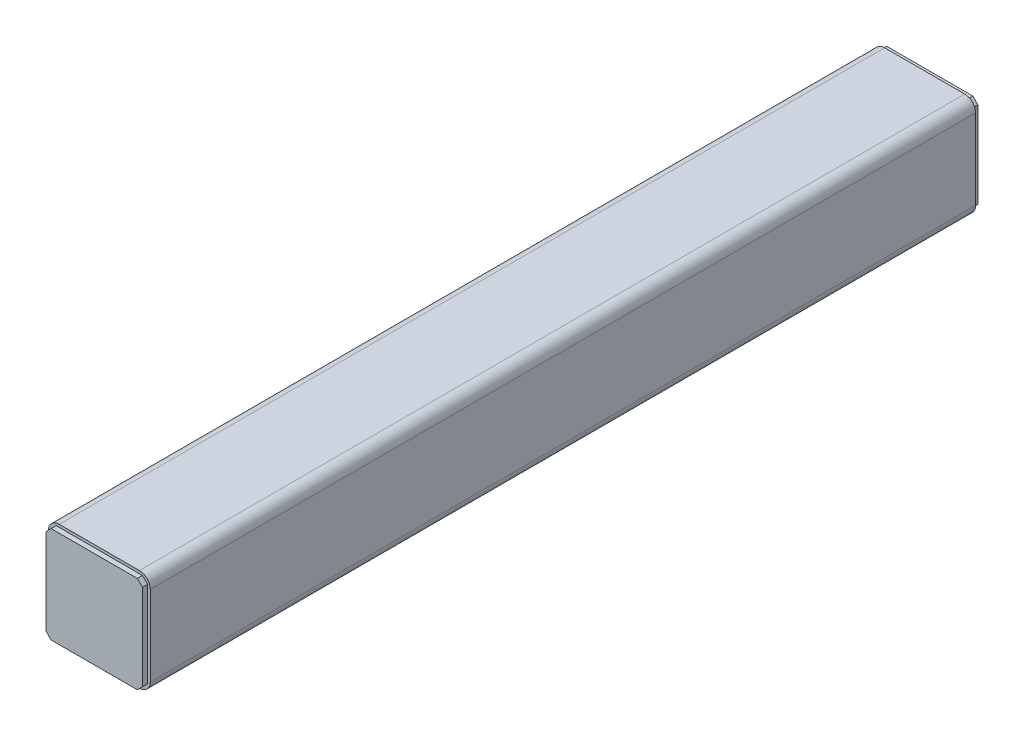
ISO-10303-21;
HEADER;
FILE_DESCRIPTION(('STEP AP214'),'2;1');
FILE_NAME('part.step','',(''),(''),'','','');
FILE_SCHEMA(('AUTOMOTIVE_DESIGN { 1 0 10303 214 1 1 1 1 }'));
ENDSEC;
DATA;
#1=APPLICATION_CONTEXT('core data for automotive mechanical design processes');
#2=APPLICATION_PROTOCOL_DEFINITION('international standard','automotive_design',2000,#1);
#3=PRODUCT_CONTEXT('',#1,'mechanical');
#4=PRODUCT('Part','Part','',(#3));
#5=PRODUCT_RELATED_PRODUCT_CATEGORY('part','',(#4));
#6=PRODUCT_DEFINITION_FORMATION('','',#4);
#7=PRODUCT_DEFINITION_CONTEXT('part definition',#1,'design');
#8=PRODUCT_DEFINITION('design','',#6,#7);
#9=PRODUCT_DEFINITION_SHAPE('','',#8);
#10=(LENGTH_UNIT() NAMED_UNIT(*) SI_UNIT(.MILLI.,.METRE.));
#11=(NAMED_UNIT(*) PLANE_ANGLE_UNIT() SI_UNIT($,.RADIAN.));
#12=(NAMED_UNIT(*) SI_UNIT($,.STERADIAN.) SOLID_ANGLE_UNIT());
#13=UNCERTAINTY_MEASURE_WITH_UNIT(LENGTH_MEASURE(1.E-05),#10,'distance_accuracy_value','');
#14=(GEOMETRIC_REPRESENTATION_CONTEXT(3) GLOBAL_UNCERTAINTY_ASSIGNED_CONTEXT((#13)) GLOBAL_UNIT_ASSIGNED_CONTEXT((#10,
#11,#12)) REPRESENTATION_CONTEXT('',''));
#15=CARTESIAN_POINT('',(0.,0.,0.));
#16=DIRECTION('',(0.,0.,1.));
#17=DIRECTION('',(1.,0.,0.));
#18=AXIS2_PLACEMENT_3D('',#15,#16,#17);
#19=CARTESIAN_POINT('',(28.4,25.4,-3.));
#20=DIRECTION('',(0.707106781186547,0.707106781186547,0.));
#21=DIRECTION('',(-0.707106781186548,0.707106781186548,0.));
#22=AXIS2_PLACEMENT_3D('',#19,#20,#21);
#23=PLANE('',#22);
#24=DIRECTION('',(-0.707106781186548,0.707106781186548,0.));
#25=VECTOR('',#24,1.);
#26=CARTESIAN_POINT('',(28.4,25.4,0.));
#27=LINE('',#26,#25);
#28=CARTESIAN_POINT('',(28.4,25.4,0.));
#29=VERTEX_POINT('',#28);
#30=CARTESIAN_POINT('',(25.4,28.4,0.));
#31=VERTEX_POINT('',#30);
#32=EDGE_CURVE('E194',#29,#31,#27,.T.);
#33=ORIENTED_EDGE('',*,*,#32,.F.);
#34=DIRECTION('',(0.,0.,1.));
#35=VECTOR('',#34,1.);
#36=CARTESIAN_POINT('',(28.4,25.4,-3.));
#37=LINE('',#36,#35);
#38=CARTESIAN_POINT('',(28.4,25.4,-3.));
#39=VERTEX_POINT('',#38);
#40=EDGE_CURVE('E13',#39,#29,#37,.T.);
#41=ORIENTED_EDGE('',*,*,#40,.F.);
#42=DIRECTION('',(-0.707106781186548,0.707106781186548,0.));
#43=VECTOR('',#42,1.);
#44=CARTESIAN_POINT('',(28.4,25.4,-3.));
#45=LINE('',#44,#43);
#46=CARTESIAN_POINT('',(25.4,28.4,-3.));
#47=VERTEX_POINT('',#46);
#48=EDGE_CURVE('E214',#39,#47,#45,.T.);
#49=ORIENTED_EDGE('',*,*,#48,.T.);
#50=DIRECTION('',(0.,0.,1.));
#51=VECTOR('',#50,1.);
#52=CARTESIAN_POINT('',(25.4,28.4,-3.));
#53=LINE('',#52,#51);
#54=EDGE_CURVE('E100',#47,#31,#53,.T.);
#55=ORIENTED_EDGE('',*,*,#54,.T.);
#56=EDGE_LOOP('',(#33,#41,#49,#55));
#57=FACE_BOUND('',#56,.T.);
#58=ADVANCED_FACE('F97',(#57),#23,.T.);
#59=CARTESIAN_POINT('',(28.4,-25.4,-3.));
#60=DIRECTION('',(1.,0.,0.));
#61=DIRECTION('',(0.,1.,0.));
#62=AXIS2_PLACEMENT_3D('',#59,#60,#61);
#63=PLANE('',#62);
#64=DIRECTION('',(0.,1.,0.));
#65=VECTOR('',#64,1.);
#66=CARTESIAN_POINT('',(28.4,-25.4,0.));
#67=LINE('',#66,#65);
#68=CARTESIAN_POINT('',(28.4,-25.4,0.));
#69=VERTEX_POINT('',#68);
#70=EDGE_CURVE('E212',#69,#29,#67,.T.);
#71=ORIENTED_EDGE('',*,*,#70,.F.);
#72=DIRECTION('',(0.,0.,1.));
#73=VECTOR('',#72,1.);
#74=CARTESIAN_POINT('',(28.4,-25.4,-3.));
#75=LINE('',#74,#73);
#76=CARTESIAN_POINT('',(28.4,-25.4,-3.));
#77=VERTEX_POINT('',#76);
#78=EDGE_CURVE('E106',#77,#69,#75,.T.);
#79=ORIENTED_EDGE('',*,*,#78,.F.);
#80=DIRECTION('',(0.,1.,0.));
#81=VECTOR('',#80,1.);
#82=CARTESIAN_POINT('',(28.4,-25.4,-3.));
#83=LINE('',#82,#81);
#84=EDGE_CURVE('E184',#77,#39,#83,.T.);
#85=ORIENTED_EDGE('',*,*,#84,.T.);
#86=ORIENTED_EDGE('',*,*,#40,.T.);
#87=EDGE_LOOP('',(#71,#79,#85,#86));
#88=FACE_BOUND('',#87,.T.);
#89=ADVANCED_FACE('F226',(#88),#63,.T.);
#90=CARTESIAN_POINT('',(25.4,-28.4,-3.));
#91=DIRECTION('',(0.707106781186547,-0.707106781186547,0.));
#92=DIRECTION('',(0.707106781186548,0.707106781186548,0.));
#93=AXIS2_PLACEMENT_3D('',#90,#91,#92);
#94=PLANE('',#93);
#95=DIRECTION('',(0.707106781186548,0.707106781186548,0.));
#96=VECTOR('',#95,1.);
#97=CARTESIAN_POINT('',(25.4,-28.4,0.));
#98=LINE('',#97,#96);
#99=CARTESIAN_POINT('',(25.4,-28.4,0.));
#100=VERTEX_POINT('',#99);
#101=EDGE_CURVE('E171',#100,#69,#98,.T.);
#102=ORIENTED_EDGE('',*,*,#101,.F.);
#103=DIRECTION('',(0.,0.,1.));
#104=VECTOR('',#103,1.);
#105=CARTESIAN_POINT('',(25.4,-28.4,-3.));
#106=LINE('',#105,#104);
#107=CARTESIAN_POINT('',(25.4,-28.4,-3.));
#108=VERTEX_POINT('',#107);
#109=EDGE_CURVE('E166',#108,#100,#106,.T.);
#110=ORIENTED_EDGE('',*,*,#109,.F.);
#111=DIRECTION('',(0.707106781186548,0.707106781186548,0.));
#112=VECTOR('',#111,1.);
#113=CARTESIAN_POINT('',(25.4,-28.4,-3.));
#114=LINE('',#113,#112);
#115=EDGE_CURVE('E169',#108,#77,#114,.T.);
#116=ORIENTED_EDGE('',*,*,#115,.T.);
#117=ORIENTED_EDGE('',*,*,#78,.T.);
#118=EDGE_LOOP('',(#102,#110,#116,#117));
#119=FACE_BOUND('',#118,.T.);
#120=ADVANCED_FACE('F168',(#119),#94,.T.);
#121=CARTESIAN_POINT('',(-25.4,-28.4,-3.));
#122=DIRECTION('',(0.,-1.,0.));
#123=DIRECTION('',(1.,0.,0.));
#124=AXIS2_PLACEMENT_3D('',#121,#122,#123);
#125=PLANE('',#124);
#126=DIRECTION('',(1.,0.,0.));
#127=VECTOR('',#126,1.);
#128=CARTESIAN_POINT('',(-25.4,-28.4,0.));
#129=LINE('',#128,#127);
#130=CARTESIAN_POINT('',(-25.4,-28.4,0.));
#131=VERTEX_POINT('',#130);
#132=EDGE_CURVE('E209',#131,#100,#129,.T.);
#133=ORIENTED_EDGE('',*,*,#132,.F.);
#134=DIRECTION('',(0.,0.,1.));
#135=VECTOR('',#134,1.);
#136=CARTESIAN_POINT('',(-25.4,-28.4,-3.));
#137=LINE('',#136,#135);
#138=CARTESIAN_POINT('',(-25.4,-28.4,-3.));
#139=VERTEX_POINT('',#138);
#140=EDGE_CURVE('E176',#139,#131,#137,.T.);
#141=ORIENTED_EDGE('',*,*,#140,.F.);
#142=DIRECTION('',(1.,0.,0.));
#143=VECTOR('',#142,1.);
#144=CARTESIAN_POINT('',(-25.4,-28.4,-3.));
#145=LINE('',#144,#143);
#146=EDGE_CURVE('E182',#139,#108,#145,.T.);
#147=ORIENTED_EDGE('',*,*,#146,.T.);
#148=ORIENTED_EDGE('',*,*,#109,.T.);
#149=EDGE_LOOP('',(#133,#141,#147,#148));
#150=FACE_BOUND('',#149,.T.);
#151=ADVANCED_FACE('F186',(#150),#125,.T.);
#152=CARTESIAN_POINT('',(-28.4,-25.4,-3.));
#153=DIRECTION('',(-0.707106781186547,-0.707106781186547,0.));
#154=DIRECTION('',(0.707106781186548,-0.707106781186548,0.));
#155=AXIS2_PLACEMENT_3D('',#152,#153,#154);
#156=PLANE('',#155);
#157=DIRECTION('',(0.707106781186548,-0.707106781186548,0.));
#158=VECTOR('',#157,1.);
#159=CARTESIAN_POINT('',(-28.4,-25.4,0.));
#160=LINE('',#159,#158);
#161=CARTESIAN_POINT('',(-28.4,-25.4,0.));
#162=VERTEX_POINT('',#161);
#163=EDGE_CURVE('E206',#162,#131,#160,.T.);
#164=ORIENTED_EDGE('',*,*,#163,.F.);
#165=DIRECTION('',(0.,0.,1.));
#166=VECTOR('',#165,1.);
#167=CARTESIAN_POINT('',(-28.4,-25.4,-3.));
#168=LINE('',#167,#166);
#169=CARTESIAN_POINT('',(-28.4,-25.4,-3.));
#170=VERTEX_POINT('',#169);
#171=EDGE_CURVE('E218',#170,#162,#168,.T.);
#172=ORIENTED_EDGE('',*,*,#171,.F.);
#173=DIRECTION('',(0.707106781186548,-0.707106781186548,0.));
#174=VECTOR('',#173,1.);
#175=CARTESIAN_POINT('',(-28.4,-25.4,-3.));
#176=LINE('',#175,#174);
#177=EDGE_CURVE('E187',#170,#139,#176,.T.);
#178=ORIENTED_EDGE('',*,*,#177,.T.);
#179=ORIENTED_EDGE('',*,*,#140,.T.);
#180=EDGE_LOOP('',(#164,#172,#178,#179));
#181=FACE_BOUND('',#180,.T.);
#182=ADVANCED_FACE('F239',(#181),#156,.T.);
#183=CARTESIAN_POINT('',(-28.4,25.4,-3.));
#184=DIRECTION('',(-1.,0.,0.));
#185=DIRECTION('',(0.,-1.,0.));
#186=AXIS2_PLACEMENT_3D('',#183,#184,#185);
#187=PLANE('',#186);
#188=DIRECTION('',(0.,-1.,0.));
#189=VECTOR('',#188,1.);
#190=CARTESIAN_POINT('',(-28.4,25.4,0.));
#191=LINE('',#190,#189);
#192=CARTESIAN_POINT('',(-28.4,25.4,0.));
#193=VERTEX_POINT('',#192);
#194=EDGE_CURVE('E203',#193,#162,#191,.T.);
#195=ORIENTED_EDGE('',*,*,#194,.F.);
#196=DIRECTION('',(0.,0.,1.));
#197=VECTOR('',#196,1.);
#198=CARTESIAN_POINT('',(-28.4,25.4,-3.));
#199=LINE('',#198,#197);
#200=CARTESIAN_POINT('',(-28.4,25.4,-3.));
#201=VERTEX_POINT('',#200);
#202=EDGE_CURVE('E220',#201,#193,#199,.T.);
#203=ORIENTED_EDGE('',*,*,#202,.F.);
#204=DIRECTION('',(0.,-1.,0.));
#205=VECTOR('',#204,1.);
#206=CARTESIAN_POINT('',(-28.4,25.4,-3.));
#207=LINE('',#206,#205);
#208=EDGE_CURVE('E189',#201,#170,#207,.T.);
#209=ORIENTED_EDGE('',*,*,#208,.T.);
#210=ORIENTED_EDGE('',*,*,#171,.T.);
#211=EDGE_LOOP('',(#195,#203,#209,#210));
#212=FACE_BOUND('',#211,.T.);
#213=ADVANCED_FACE('F242',(#212),#187,.T.);
#214=CARTESIAN_POINT('',(-25.4,28.4,-3.));
#215=DIRECTION('',(-0.707106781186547,0.707106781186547,0.));
#216=DIRECTION('',(-0.707106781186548,-0.707106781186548,0.));
#217=AXIS2_PLACEMENT_3D('',#214,#215,#216);
#218=PLANE('',#217);
#219=DIRECTION('',(-0.707106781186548,-0.707106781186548,0.));
#220=VECTOR('',#219,1.);
#221=CARTESIAN_POINT('',(-25.4,28.4,0.));
#222=LINE('',#221,#220);
#223=CARTESIAN_POINT('',(-25.4,28.4,0.));
#224=VERTEX_POINT('',#223);
#225=EDGE_CURVE('E200',#224,#193,#222,.T.);
#226=ORIENTED_EDGE('',*,*,#225,.F.);
#227=DIRECTION('',(0.,0.,1.));
#228=VECTOR('',#227,1.);
#229=CARTESIAN_POINT('',(-25.4,28.4,-3.));
#230=LINE('',#229,#228);
#231=CARTESIAN_POINT('',(-25.4,28.4,-3.));
#232=VERTEX_POINT('',#231);
#233=EDGE_CURVE('E221',#232,#224,#230,.T.);
#234=ORIENTED_EDGE('',*,*,#233,.F.);
#235=DIRECTION('',(-0.707106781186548,-0.707106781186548,0.));
#236=VECTOR('',#235,1.);
#237=CARTESIAN_POINT('',(-25.4,28.4,-3.));
#238=LINE('',#237,#236);
#239=EDGE_CURVE('E317',#232,#201,#238,.T.);
#240=ORIENTED_EDGE('',*,*,#239,.T.);
#241=ORIENTED_EDGE('',*,*,#202,.T.);
#242=EDGE_LOOP('',(#226,#234,#240,#241));
#243=FACE_BOUND('',#242,.T.);
#244=ADVANCED_FACE('F246',(#243),#218,.T.);
#245=CARTESIAN_POINT('',(25.4,28.4,-3.));
#246=DIRECTION('',(0.,1.,0.));
#247=DIRECTION('',(-1.,0.,0.));
#248=AXIS2_PLACEMENT_3D('',#245,#246,#247);
#249=PLANE('',#248);
#250=DIRECTION('',(-1.,0.,0.));
#251=VECTOR('',#250,1.);
#252=CARTESIAN_POINT('',(25.4,28.4,0.));
#253=LINE('',#252,#251);
#254=EDGE_CURVE('E197',#31,#224,#253,.T.);
#255=ORIENTED_EDGE('',*,*,#254,.F.);
#256=ORIENTED_EDGE('',*,*,#54,.F.);
#257=DIRECTION('',(-1.,0.,0.));
#258=VECTOR('',#257,1.);
#259=CARTESIAN_POINT('',(25.4,28.4,-3.));
#260=LINE('',#259,#258);
#261=EDGE_CURVE('E318',#47,#232,#260,.T.);
#262=ORIENTED_EDGE('',*,*,#261,.T.);
#263=ORIENTED_EDGE('',*,*,#233,.T.);
#264=EDGE_LOOP('',(#255,#256,#262,#263));
#265=FACE_BOUND('',#264,.T.);
#266=ADVANCED_FACE('F223',(#265),#249,.T.);
#267=CARTESIAN_POINT('',(0.,53.8,-3.));
#268=DIRECTION('',(0.,0.,1.));
#269=DIRECTION('',(1.,0.,0.));
#270=AXIS2_PLACEMENT_3D('',#267,#268,#269);
#271=PLANE('',#270);
#272=ORIENTED_EDGE('',*,*,#48,.F.);
#273=ORIENTED_EDGE('',*,*,#84,.F.);
#274=ORIENTED_EDGE('',*,*,#115,.F.);
#275=ORIENTED_EDGE('',*,*,#146,.F.);
#276=ORIENTED_EDGE('',*,*,#177,.F.);
#277=ORIENTED_EDGE('',*,*,#208,.F.);
#278=ORIENTED_EDGE('',*,*,#239,.F.);
#279=ORIENTED_EDGE('',*,*,#261,.F.);
#280=EDGE_LOOP('',(#272,#273,#274,#275,#276,#277,#278,#279));
#281=FACE_BOUND('',#280,.T.);
#282=ADVANCED_FACE('F180',(#281),#271,.F.);
#283=CARTESIAN_POINT('',(0.,53.8,0.));
#284=DIRECTION('',(0.,0.,1.));
#285=DIRECTION('',(1.,0.,0.));
#286=AXIS2_PLACEMENT_3D('',#283,#284,#285);
#287=PLANE('',#286);
#288=ORIENTED_EDGE('',*,*,#32,.T.);
#289=ORIENTED_EDGE('',*,*,#254,.T.);
#290=ORIENTED_EDGE('',*,*,#225,.T.);
#291=ORIENTED_EDGE('',*,*,#194,.T.);
#292=ORIENTED_EDGE('',*,*,#163,.T.);
#293=ORIENTED_EDGE('',*,*,#132,.T.);
#294=ORIENTED_EDGE('',*,*,#101,.T.);
#295=ORIENTED_EDGE('',*,*,#70,.T.);
#296=EDGE_LOOP('',(#288,#289,#290,#291,#292,#293,#294,#295));
#297=FACE_BOUND('',#296,.T.);
#298=ADVANCED_FACE('F225',(#297),#287,.T.);
#299=CLOSED_SHELL('',(#58,#89,#120,#151,#182,#213,#244,#266,#282,#298));
#300=MANIFOLD_SOLID_BREP('B2',#299);
#301=CARTESIAN_POINT('',(25.4,28.4,-489.));
#302=DIRECTION('',(0.707106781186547,0.707106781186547,0.));
#303=DIRECTION('',(-0.707106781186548,0.707106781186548,0.));
#304=AXIS2_PLACEMENT_3D('',#301,#302,#303);
#305=PLANE('',#304);
#306=DIRECTION('',(0.707106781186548,-0.707106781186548,0.));
#307=VECTOR('',#306,1.);
#308=CARTESIAN_POINT('',(25.4,28.4,-492.));
#309=LINE('',#308,#307);
#310=CARTESIAN_POINT('',(25.4,28.4,-492.));
#311=VERTEX_POINT('',#310);
#312=CARTESIAN_POINT('',(28.4,25.4,-492.));
#313=VERTEX_POINT('',#312);
#314=EDGE_CURVE('E430',#311,#313,#309,.T.);
#315=ORIENTED_EDGE('',*,*,#314,.F.);
#316=DIRECTION('',(0.,0.,-1.));
#317=VECTOR('',#316,1.);
#318=CARTESIAN_POINT('',(25.4,28.4,-489.));
#319=LINE('',#318,#317);
#320=CARTESIAN_POINT('',(25.4,28.4,-489.));
#321=VERTEX_POINT('',#320);
#322=EDGE_CURVE('E95',#321,#311,#319,.T.);
#323=ORIENTED_EDGE('',*,*,#322,.F.);
#324=DIRECTION('',(0.707106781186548,-0.707106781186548,0.));
#325=VECTOR('',#324,1.);
#326=CARTESIAN_POINT('',(25.4,28.4,-489.));
#327=LINE('',#326,#325);
#328=CARTESIAN_POINT('',(28.4,25.4,-489.));
#329=VERTEX_POINT('',#328);
#330=EDGE_CURVE('E450',#321,#329,#327,.T.);
#331=ORIENTED_EDGE('',*,*,#330,.T.);
#332=DIRECTION('',(0.,0.,-1.));
#333=VECTOR('',#332,1.);
#334=CARTESIAN_POINT('',(28.4,25.4,-489.));
#335=LINE('',#334,#333);
#336=EDGE_CURVE('E336',#329,#313,#335,.T.);
#337=ORIENTED_EDGE('',*,*,#336,.T.);
#338=EDGE_LOOP('',(#315,#323,#331,#337));
#339=FACE_BOUND('',#338,.T.);
#340=ADVANCED_FACE('F333',(#339),#305,.T.);
#341=CARTESIAN_POINT('',(-25.4,28.4,-489.));
#342=DIRECTION('',(0.,1.,0.));
#343=DIRECTION('',(-1.,0.,0.));
#344=AXIS2_PLACEMENT_3D('',#341,#342,#343);
#345=PLANE('',#344);
#346=DIRECTION('',(1.,0.,0.));
#347=VECTOR('',#346,1.);
#348=CARTESIAN_POINT('',(-25.4,28.4,-492.));
#349=LINE('',#348,#347);
#350=CARTESIAN_POINT('',(-25.4,28.4,-492.));
#351=VERTEX_POINT('',#350);
#352=EDGE_CURVE('E448',#351,#311,#349,.T.);
#353=ORIENTED_EDGE('',*,*,#352,.F.);
#354=DIRECTION('',(0.,0.,-1.));
#355=VECTOR('',#354,1.);
#356=CARTESIAN_POINT('',(-25.4,28.4,-489.));
#357=LINE('',#356,#355);
#358=CARTESIAN_POINT('',(-25.4,28.4,-489.));
#359=VERTEX_POINT('',#358);
#360=EDGE_CURVE('E342',#359,#351,#357,.T.);
#361=ORIENTED_EDGE('',*,*,#360,.F.);
#362=DIRECTION('',(1.,0.,0.));
#363=VECTOR('',#362,1.);
#364=CARTESIAN_POINT('',(-25.4,28.4,-489.));
#365=LINE('',#364,#363);
#366=EDGE_CURVE('E420',#359,#321,#365,.T.);
#367=ORIENTED_EDGE('',*,*,#366,.T.);
#368=ORIENTED_EDGE('',*,*,#322,.T.);
#369=EDGE_LOOP('',(#353,#361,#367,#368));
#370=FACE_BOUND('',#369,.T.);
#371=ADVANCED_FACE('F462',(#370),#345,.T.);
#372=CARTESIAN_POINT('',(-28.4,25.4,-489.));
#373=DIRECTION('',(-0.707106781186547,0.707106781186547,0.));
#374=DIRECTION('',(-0.707106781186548,-0.707106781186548,0.));
#375=AXIS2_PLACEMENT_3D('',#372,#373,#374);
#376=PLANE('',#375);
#377=DIRECTION('',(0.707106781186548,0.707106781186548,0.));
#378=VECTOR('',#377,1.);
#379=CARTESIAN_POINT('',(-28.4,25.4,-492.));
#380=LINE('',#379,#378);
#381=CARTESIAN_POINT('',(-28.4,25.4,-492.));
#382=VERTEX_POINT('',#381);
#383=EDGE_CURVE('E407',#382,#351,#380,.T.);
#384=ORIENTED_EDGE('',*,*,#383,.F.);
#385=DIRECTION('',(0.,0.,-1.));
#386=VECTOR('',#385,1.);
#387=CARTESIAN_POINT('',(-28.4,25.4,-489.));
#388=LINE('',#387,#386);
#389=CARTESIAN_POINT('',(-28.4,25.4,-489.));
#390=VERTEX_POINT('',#389);
#391=EDGE_CURVE('E402',#390,#382,#388,.T.);
#392=ORIENTED_EDGE('',*,*,#391,.F.);
#393=DIRECTION('',(0.707106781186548,0.707106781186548,0.));
#394=VECTOR('',#393,1.);
#395=CARTESIAN_POINT('',(-28.4,25.4,-489.));
#396=LINE('',#395,#394);
#397=EDGE_CURVE('E405',#390,#359,#396,.T.);
#398=ORIENTED_EDGE('',*,*,#397,.T.);
#399=ORIENTED_EDGE('',*,*,#360,.T.);
#400=EDGE_LOOP('',(#384,#392,#398,#399));
#401=FACE_BOUND('',#400,.T.);
#402=ADVANCED_FACE('F404',(#401),#376,.T.);
#403=CARTESIAN_POINT('',(-28.4,-25.4,-489.));
#404=DIRECTION('',(-1.,0.,0.));
#405=DIRECTION('',(0.,0.,1.));
#406=AXIS2_PLACEMENT_3D('',#403,#404,#405);
#407=PLANE('',#406);
#408=DIRECTION('',(0.,1.,0.));
#409=VECTOR('',#408,1.);
#410=CARTESIAN_POINT('',(-28.4,-25.4,-492.));
#411=LINE('',#410,#409);
#412=CARTESIAN_POINT('',(-28.4,-25.4,-492.));
#413=VERTEX_POINT('',#412);
#414=EDGE_CURVE('E445',#413,#382,#411,.T.);
#415=ORIENTED_EDGE('',*,*,#414,.F.);
#416=DIRECTION('',(0.,0.,-1.));
#417=VECTOR('',#416,1.);
#418=CARTESIAN_POINT('',(-28.4,-25.4,-489.));
#419=LINE('',#418,#417);
#420=CARTESIAN_POINT('',(-28.4,-25.4,-489.));
#421=VERTEX_POINT('',#420);
#422=EDGE_CURVE('E412',#421,#413,#419,.T.);
#423=ORIENTED_EDGE('',*,*,#422,.F.);
#424=DIRECTION('',(0.,1.,0.));
#425=VECTOR('',#424,1.);
#426=CARTESIAN_POINT('',(-28.4,-25.4,-489.));
#427=LINE('',#426,#425);
#428=EDGE_CURVE('E418',#421,#390,#427,.T.);
#429=ORIENTED_EDGE('',*,*,#428,.T.);
#430=ORIENTED_EDGE('',*,*,#391,.T.);
#431=EDGE_LOOP('',(#415,#423,#429,#430));
#432=FACE_BOUND('',#431,.T.);
#433=ADVANCED_FACE('F422',(#432),#407,.T.);
#434=CARTESIAN_POINT('',(-25.4,-28.4,-489.));
#435=DIRECTION('',(-0.707106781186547,-0.707106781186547,0.));
#436=DIRECTION('',(0.707106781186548,-0.707106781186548,0.));
#437=AXIS2_PLACEMENT_3D('',#434,#435,#436);
#438=PLANE('',#437);
#439=DIRECTION('',(-0.707106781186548,0.707106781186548,0.));
#440=VECTOR('',#439,1.);
#441=CARTESIAN_POINT('',(-25.4,-28.4,-492.));
#442=LINE('',#441,#440);
#443=CARTESIAN_POINT('',(-25.4,-28.4,-492.));
#444=VERTEX_POINT('',#443);
#445=EDGE_CURVE('E442',#444,#413,#442,.T.);
#446=ORIENTED_EDGE('',*,*,#445,.F.);
#447=DIRECTION('',(0.,0.,-1.));
#448=VECTOR('',#447,1.);
#449=CARTESIAN_POINT('',(-25.4,-28.4,-489.));
#450=LINE('',#449,#448);
#451=CARTESIAN_POINT('',(-25.4,-28.4,-489.));
#452=VERTEX_POINT('',#451);
#453=EDGE_CURVE('E454',#452,#444,#450,.T.);
#454=ORIENTED_EDGE('',*,*,#453,.F.);
#455=DIRECTION('',(-0.707106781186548,0.707106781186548,0.));
#456=VECTOR('',#455,1.);
#457=CARTESIAN_POINT('',(-25.4,-28.4,-489.));
#458=LINE('',#457,#456);
#459=EDGE_CURVE('E423',#452,#421,#458,.T.);
#460=ORIENTED_EDGE('',*,*,#459,.T.);
#461=ORIENTED_EDGE('',*,*,#422,.T.);
#462=EDGE_LOOP('',(#446,#454,#460,#461));
#463=FACE_BOUND('',#462,.T.);
#464=ADVANCED_FACE('F475',(#463),#438,.T.);
#465=CARTESIAN_POINT('',(25.4,-28.4,-489.));
#466=DIRECTION('',(0.,-1.,0.));
#467=DIRECTION('',(1.,0.,0.));
#468=AXIS2_PLACEMENT_3D('',#465,#466,#467);
#469=PLANE('',#468);
#470=DIRECTION('',(-1.,0.,0.));
#471=VECTOR('',#470,1.);
#472=CARTESIAN_POINT('',(25.4,-28.4,-492.));
#473=LINE('',#472,#471);
#474=CARTESIAN_POINT('',(25.4,-28.4,-492.));
#475=VERTEX_POINT('',#474);
#476=EDGE_CURVE('E439',#475,#444,#473,.T.);
#477=ORIENTED_EDGE('',*,*,#476,.F.);
#478=DIRECTION('',(0.,0.,-1.));
#479=VECTOR('',#478,1.);
#480=CARTESIAN_POINT('',(25.4,-28.4,-489.));
#481=LINE('',#480,#479);
#482=CARTESIAN_POINT('',(25.4,-28.4,-489.));
#483=VERTEX_POINT('',#482);
#484=EDGE_CURVE('E456',#483,#475,#481,.T.);
#485=ORIENTED_EDGE('',*,*,#484,.F.);
#486=DIRECTION('',(-1.,0.,0.));
#487=VECTOR('',#486,1.);
#488=CARTESIAN_POINT('',(25.4,-28.4,-489.));
#489=LINE('',#488,#487);
#490=EDGE_CURVE('E425',#483,#452,#489,.T.);
#491=ORIENTED_EDGE('',*,*,#490,.T.);
#492=ORIENTED_EDGE('',*,*,#453,.T.);
#493=EDGE_LOOP('',(#477,#485,#491,#492));
#494=FACE_BOUND('',#493,.T.);
#495=ADVANCED_FACE('F478',(#494),#469,.T.);
#496=CARTESIAN_POINT('',(28.4,-25.4,-489.));
#497=DIRECTION('',(0.707106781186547,-0.707106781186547,0.));
#498=DIRECTION('',(0.707106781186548,0.707106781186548,0.));
#499=AXIS2_PLACEMENT_3D('',#496,#497,#498);
#500=PLANE('',#499);
#501=DIRECTION('',(-0.707106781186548,-0.707106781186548,0.));
#502=VECTOR('',#501,1.);
#503=CARTESIAN_POINT('',(28.4,-25.4,-492.));
#504=LINE('',#503,#502);
#505=CARTESIAN_POINT('',(28.4,-25.4,-492.));
#506=VERTEX_POINT('',#505);
#507=EDGE_CURVE('E436',#506,#475,#504,.T.);
#508=ORIENTED_EDGE('',*,*,#507,.F.);
#509=DIRECTION('',(0.,0.,-1.));
#510=VECTOR('',#509,1.);
#511=CARTESIAN_POINT('',(28.4,-25.4,-489.));
#512=LINE('',#511,#510);
#513=CARTESIAN_POINT('',(28.4,-25.4,-489.));
#514=VERTEX_POINT('',#513);
#515=EDGE_CURVE('E457',#514,#506,#512,.T.);
#516=ORIENTED_EDGE('',*,*,#515,.F.);
#517=DIRECTION('',(-0.707106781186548,-0.707106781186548,0.));
#518=VECTOR('',#517,1.);
#519=CARTESIAN_POINT('',(28.4,-25.4,-489.));
#520=LINE('',#519,#518);
#521=EDGE_CURVE('E555',#514,#483,#520,.T.);
#522=ORIENTED_EDGE('',*,*,#521,.T.);
#523=ORIENTED_EDGE('',*,*,#484,.T.);
#524=EDGE_LOOP('',(#508,#516,#522,#523));
#525=FACE_BOUND('',#524,.T.);
#526=ADVANCED_FACE('F482',(#525),#500,.T.);
#527=CARTESIAN_POINT('',(28.4,25.4,-489.));
#528=DIRECTION('',(1.,0.,0.));
#529=DIRECTION('',(0.,1.,0.));
#530=AXIS2_PLACEMENT_3D('',#527,#528,#529);
#531=PLANE('',#530);
#532=DIRECTION('',(0.,-1.,0.));
#533=VECTOR('',#532,1.);
#534=CARTESIAN_POINT('',(28.4,25.4,-492.));
#535=LINE('',#534,#533);
#536=EDGE_CURVE('E433',#313,#506,#535,.T.);
#537=ORIENTED_EDGE('',*,*,#536,.F.);
#538=ORIENTED_EDGE('',*,*,#336,.F.);
#539=DIRECTION('',(0.,-1.,0.));
#540=VECTOR('',#539,1.);
#541=CARTESIAN_POINT('',(28.4,25.4,-489.));
#542=LINE('',#541,#540);
#543=EDGE_CURVE('E556',#329,#514,#542,.T.);
#544=ORIENTED_EDGE('',*,*,#543,.T.);
#545=ORIENTED_EDGE('',*,*,#515,.T.);
#546=EDGE_LOOP('',(#537,#538,#544,#545));
#547=FACE_BOUND('',#546,.T.);
#548=ADVANCED_FACE('F459',(#547),#531,.T.);
#549=CARTESIAN_POINT('',(53.8,0.,-489.));
#550=DIRECTION('',(0.,0.,-1.));
#551=DIRECTION('',(-1.,0.,0.));
#552=AXIS2_PLACEMENT_3D('',#549,#550,#551);
#553=PLANE('',#552);
#554=ORIENTED_EDGE('',*,*,#330,.F.);
#555=ORIENTED_EDGE('',*,*,#366,.F.);
#556=ORIENTED_EDGE('',*,*,#397,.F.);
#557=ORIENTED_EDGE('',*,*,#428,.F.);
#558=ORIENTED_EDGE('',*,*,#459,.F.);
#559=ORIENTED_EDGE('',*,*,#490,.F.);
#560=ORIENTED_EDGE('',*,*,#521,.F.);
#561=ORIENTED_EDGE('',*,*,#543,.F.);
#562=EDGE_LOOP('',(#554,#555,#556,#557,#558,#559,#560,#561));
#563=FACE_BOUND('',#562,.T.);
#564=ADVANCED_FACE('F416',(#563),#553,.F.);
#565=CARTESIAN_POINT('',(53.8,0.,-492.));
#566=DIRECTION('',(0.,0.,-1.));
#567=DIRECTION('',(-1.,0.,0.));
#568=AXIS2_PLACEMENT_3D('',#565,#566,#567);
#569=PLANE('',#568);
#570=ORIENTED_EDGE('',*,*,#314,.T.);
#571=ORIENTED_EDGE('',*,*,#536,.T.);
#572=ORIENTED_EDGE('',*,*,#507,.T.);
#573=ORIENTED_EDGE('',*,*,#476,.T.);
#574=ORIENTED_EDGE('',*,*,#445,.T.);
#575=ORIENTED_EDGE('',*,*,#414,.T.);
#576=ORIENTED_EDGE('',*,*,#383,.T.);
#577=ORIENTED_EDGE('',*,*,#352,.T.);
#578=EDGE_LOOP('',(#570,#571,#572,#573,#574,#575,#576,#577));
#579=FACE_BOUND('',#578,.T.);
#580=ADVANCED_FACE('F461',(#579),#569,.T.);
#581=CLOSED_SHELL('',(#340,#371,#402,#433,#464,#495,#526,#548,#564,#580));
#582=MANIFOLD_SOLID_BREP('B7',#581);
#583=CARTESIAN_POINT('',(23.6,23.6,-492.));
#584=DIRECTION('',(0.,0.,1.));
#585=DIRECTION('',(1.,0.,0.));
#586=AXIS2_PLACEMENT_3D('',#583,#584,#585);
#587=CYLINDRICAL_SURFACE('',#586,6.4);
#588=CARTESIAN_POINT('',(23.6,23.6,-3.));
#589=DIRECTION('',(0.,0.,1.));
#590=DIRECTION('',(1.,0.,0.));
#591=AXIS2_PLACEMENT_3D('',#588,#589,#590);
#592=CIRCLE('',#591,6.4);
#593=CARTESIAN_POINT('',(23.6,30.,-3.));
#594=VERTEX_POINT('',#593);
#595=CARTESIAN_POINT('',(30.,23.6,-3.));
#596=VERTEX_POINT('',#595);
#597=EDGE_CURVE('E765',#594,#596,#592,.F.);
#598=ORIENTED_EDGE('',*,*,#597,.T.);
#599=DIRECTION('',(0.,0.,1.));
#600=VECTOR('',#599,1.);
#601=CARTESIAN_POINT('',(30.,23.6,-492.));
#602=LINE('',#601,#600);
#603=CARTESIAN_POINT('',(30.,23.6,-489.));
#604=VERTEX_POINT('',#603);
#605=EDGE_CURVE('E331',#604,#596,#602,.T.);
#606=ORIENTED_EDGE('',*,*,#605,.F.);
#607=CARTESIAN_POINT('',(23.6,23.6,-489.));
#608=DIRECTION('',(0.,0.,-1.));
#609=DIRECTION('',(-1.,0.,0.));
#610=AXIS2_PLACEMENT_3D('',#607,#608,#609);
#611=CIRCLE('',#610,6.4);
#612=CARTESIAN_POINT('',(23.6,30.,-489.));
#613=VERTEX_POINT('',#612);
#614=EDGE_CURVE('E712',#613,#604,#611,.T.);
#615=ORIENTED_EDGE('',*,*,#614,.F.);
#616=DIRECTION('',(0.,0.,1.));
#617=VECTOR('',#616,1.);
#618=CARTESIAN_POINT('',(23.6,30.,-492.));
#619=LINE('',#618,#617);
#620=EDGE_CURVE('E797',#613,#594,#619,.T.);
#621=ORIENTED_EDGE('',*,*,#620,.T.);
#622=EDGE_LOOP('',(#598,#606,#615,#621));
#623=FACE_BOUND('',#622,.T.);
#624=ADVANCED_FACE('F562',(#623),#587,.T.);
#625=CARTESIAN_POINT('',(30.,23.6,-492.));
#626=DIRECTION('',(-1.,0.,0.));
#627=DIRECTION('',(0.,-1.,0.));
#628=AXIS2_PLACEMENT_3D('',#625,#626,#627);
#629=PLANE('',#628);
#630=DIRECTION('',(0.,1.,0.));
#631=VECTOR('',#630,1.);
#632=CARTESIAN_POINT('',(30.,23.6,-3.));
#633=LINE('',#632,#631);
#634=CARTESIAN_POINT('',(30.,-23.6,-3.));
#635=VERTEX_POINT('',#634);
#636=EDGE_CURVE('E768',#596,#635,#633,.F.);
#637=ORIENTED_EDGE('',*,*,#636,.T.);
#638=DIRECTION('',(0.,0.,1.));
#639=VECTOR('',#638,1.);
#640=CARTESIAN_POINT('',(30.,-23.6,-492.));
#641=LINE('',#640,#639);
#642=CARTESIAN_POINT('',(30.,-23.6,-489.));
#643=VERTEX_POINT('',#642);
#644=EDGE_CURVE('E572',#643,#635,#641,.T.);
#645=ORIENTED_EDGE('',*,*,#644,.F.);
#646=DIRECTION('',(0.,-1.,0.));
#647=VECTOR('',#646,1.);
#648=CARTESIAN_POINT('',(30.,23.6,-489.));
#649=LINE('',#648,#647);
#650=EDGE_CURVE('E714',#604,#643,#649,.T.);
#651=ORIENTED_EDGE('',*,*,#650,.F.);
#652=ORIENTED_EDGE('',*,*,#605,.T.);
#653=EDGE_LOOP('',(#637,#645,#651,#652));
#654=FACE_BOUND('',#653,.T.);
#655=ADVANCED_FACE('F849',(#654),#629,.F.);
#656=CARTESIAN_POINT('',(23.6,-23.6,-492.));
#657=DIRECTION('',(0.,0.,1.));
#658=DIRECTION('',(1.,0.,0.));
#659=AXIS2_PLACEMENT_3D('',#656,#657,#658);
#660=CYLINDRICAL_SURFACE('',#659,6.4);
#661=CARTESIAN_POINT('',(23.6,-23.6,-3.));
#662=DIRECTION('',(0.,0.,1.));
#663=DIRECTION('',(1.,0.,0.));
#664=AXIS2_PLACEMENT_3D('',#661,#662,#663);
#665=CIRCLE('',#664,6.4);
#666=CARTESIAN_POINT('',(23.6,-30.,-3.));
#667=VERTEX_POINT('',#666);
#668=EDGE_CURVE('E770',#635,#667,#665,.F.);
#669=ORIENTED_EDGE('',*,*,#668,.T.);
#670=DIRECTION('',(0.,0.,1.));
#671=VECTOR('',#670,1.);
#672=CARTESIAN_POINT('',(23.6,-30.,-492.));
#673=LINE('',#672,#671);
#674=CARTESIAN_POINT('',(23.6,-30.,-489.));
#675=VERTEX_POINT('',#674);
#676=EDGE_CURVE('E805',#675,#667,#673,.T.);
#677=ORIENTED_EDGE('',*,*,#676,.F.);
#678=CARTESIAN_POINT('',(23.6,-23.6,-489.));
#679=DIRECTION('',(0.,0.,-1.));
#680=DIRECTION('',(-1.,0.,0.));
#681=AXIS2_PLACEMENT_3D('',#678,#679,#680);
#682=CIRCLE('',#681,6.4);
#683=EDGE_CURVE('E741',#643,#675,#682,.T.);
#684=ORIENTED_EDGE('',*,*,#683,.F.);
#685=ORIENTED_EDGE('',*,*,#644,.T.);
#686=EDGE_LOOP('',(#669,#677,#684,#685));
#687=FACE_BOUND('',#686,.T.);
#688=ADVANCED_FACE('F854',(#687),#660,.T.);
#689=CARTESIAN_POINT('',(-23.6,-30.,-492.));
#690=DIRECTION('',(0.,1.,0.));
#691=DIRECTION('',(-1.,0.,0.));
#692=AXIS2_PLACEMENT_3D('',#689,#690,#691);
#693=PLANE('',#692);
#694=DIRECTION('',(1.,0.,0.));
#695=VECTOR('',#694,1.);
#696=CARTESIAN_POINT('',(-23.6,-30.,-3.));
#697=LINE('',#696,#695);
#698=CARTESIAN_POINT('',(-23.6,-30.,-3.));
#699=VERTEX_POINT('',#698);
#700=EDGE_CURVE('E772',#667,#699,#697,.F.);
#701=ORIENTED_EDGE('',*,*,#700,.T.);
#702=DIRECTION('',(0.,0.,1.));
#703=VECTOR('',#702,1.);
#704=CARTESIAN_POINT('',(-23.6,-30.,-492.));
#705=LINE('',#704,#703);
#706=CARTESIAN_POINT('',(-23.6,-30.,-489.));
#707=VERTEX_POINT('',#706);
#708=EDGE_CURVE('E802',#707,#699,#705,.T.);
#709=ORIENTED_EDGE('',*,*,#708,.F.);
#710=DIRECTION('',(-1.,0.,0.));
#711=VECTOR('',#710,1.);
#712=CARTESIAN_POINT('',(-23.6,-30.,-489.));
#713=LINE('',#712,#711);
#714=EDGE_CURVE('E739',#675,#707,#713,.T.);
#715=ORIENTED_EDGE('',*,*,#714,.F.);
#716=ORIENTED_EDGE('',*,*,#676,.T.);
#717=EDGE_LOOP('',(#701,#709,#715,#716));
#718=FACE_BOUND('',#717,.T.);
#719=ADVANCED_FACE('F860',(#718),#693,.F.);
#720=CARTESIAN_POINT('',(-23.6,-23.6,-492.));
#721=DIRECTION('',(0.,0.,1.));
#722=DIRECTION('',(1.,0.,0.));
#723=AXIS2_PLACEMENT_3D('',#720,#721,#722);
#724=CYLINDRICAL_SURFACE('',#723,6.4);
#725=CARTESIAN_POINT('',(-23.6,-23.6,-3.));
#726=DIRECTION('',(0.,0.,1.));
#727=DIRECTION('',(1.,0.,0.));
#728=AXIS2_PLACEMENT_3D('',#725,#726,#727);
#729=CIRCLE('',#728,6.4);
#730=CARTESIAN_POINT('',(-30.,-23.6,-3.));
#731=VERTEX_POINT('',#730);
#732=EDGE_CURVE('E774',#699,#731,#729,.F.);
#733=ORIENTED_EDGE('',*,*,#732,.T.);
#734=DIRECTION('',(0.,0.,1.));
#735=VECTOR('',#734,1.);
#736=CARTESIAN_POINT('',(-30.,-23.6,-492.));
#737=LINE('',#736,#735);
#738=CARTESIAN_POINT('',(-30.,-23.6,-489.));
#739=VERTEX_POINT('',#738);
#740=EDGE_CURVE('E786',#739,#731,#737,.T.);
#741=ORIENTED_EDGE('',*,*,#740,.F.);
#742=CARTESIAN_POINT('',(-23.6,-23.6,-489.));
#743=DIRECTION('',(0.,0.,-1.));
#744=DIRECTION('',(-1.,0.,0.));
#745=AXIS2_PLACEMENT_3D('',#742,#743,#744);
#746=CIRCLE('',#745,6.4);
#747=EDGE_CURVE('E737',#707,#739,#746,.T.);
#748=ORIENTED_EDGE('',*,*,#747,.F.);
#749=ORIENTED_EDGE('',*,*,#708,.T.);
#750=EDGE_LOOP('',(#733,#741,#748,#749));
#751=FACE_BOUND('',#750,.T.);
#752=ADVANCED_FACE('F864',(#751),#724,.T.);
#753=CARTESIAN_POINT('',(-30.,-23.6,-492.));
#754=DIRECTION('',(1.,0.,0.));
#755=DIRECTION('',(0.,1.,0.));
#756=AXIS2_PLACEMENT_3D('',#753,#754,#755);
#757=PLANE('',#756);
#758=DIRECTION('',(0.,-1.,0.));
#759=VECTOR('',#758,1.);
#760=CARTESIAN_POINT('',(-30.,-23.6,-3.));
#761=LINE('',#760,#759);
#762=CARTESIAN_POINT('',(-30.,23.6,-3.));
#763=VERTEX_POINT('',#762);
#764=EDGE_CURVE('E776',#731,#763,#761,.F.);
#765=ORIENTED_EDGE('',*,*,#764,.T.);
#766=DIRECTION('',(0.,0.,1.));
#767=VECTOR('',#766,1.);
#768=CARTESIAN_POINT('',(-30.,23.6,-492.));
#769=LINE('',#768,#767);
#770=CARTESIAN_POINT('',(-30.,23.6,-489.));
#771=VERTEX_POINT('',#770);
#772=EDGE_CURVE('E783',#771,#763,#769,.T.);
#773=ORIENTED_EDGE('',*,*,#772,.F.);
#774=DIRECTION('',(0.,1.,0.));
#775=VECTOR('',#774,1.);
#776=CARTESIAN_POINT('',(-30.,-23.6,-489.));
#777=LINE('',#776,#775);
#778=EDGE_CURVE('E735',#739,#771,#777,.T.);
#779=ORIENTED_EDGE('',*,*,#778,.F.);
#780=ORIENTED_EDGE('',*,*,#740,.T.);
#781=EDGE_LOOP('',(#765,#773,#779,#780));
#782=FACE_BOUND('',#781,.T.);
#783=ADVANCED_FACE('F781',(#782),#757,.F.);
#784=CARTESIAN_POINT('',(-23.6,23.6,-492.));
#785=DIRECTION('',(0.,0.,1.));
#786=DIRECTION('',(1.,0.,0.));
#787=AXIS2_PLACEMENT_3D('',#784,#785,#786);
#788=CYLINDRICAL_SURFACE('',#787,6.4);
#789=CARTESIAN_POINT('',(-23.6,23.6,-3.));
#790=DIRECTION('',(0.,0.,1.));
#791=DIRECTION('',(1.,0.,0.));
#792=AXIS2_PLACEMENT_3D('',#789,#790,#791);
#793=CIRCLE('',#792,6.4);
#794=CARTESIAN_POINT('',(-23.6,30.,-3.));
#795=VERTEX_POINT('',#794);
#796=EDGE_CURVE('E654',#763,#795,#793,.F.);
#797=ORIENTED_EDGE('',*,*,#796,.T.);
#798=DIRECTION('',(0.,0.,1.));
#799=VECTOR('',#798,1.);
#800=CARTESIAN_POINT('',(-23.6,30.,-492.));
#801=LINE('',#800,#799);
#802=CARTESIAN_POINT('',(-23.6,30.,-489.));
#803=VERTEX_POINT('',#802);
#804=EDGE_CURVE('E790',#803,#795,#801,.T.);
#805=ORIENTED_EDGE('',*,*,#804,.F.);
#806=CARTESIAN_POINT('',(-23.6,23.6,-489.));
#807=DIRECTION('',(0.,0.,-1.));
#808=DIRECTION('',(-1.,0.,0.));
#809=AXIS2_PLACEMENT_3D('',#806,#807,#808);
#810=CIRCLE('',#809,6.4);
#811=EDGE_CURVE('E733',#771,#803,#810,.T.);
#812=ORIENTED_EDGE('',*,*,#811,.F.);
#813=ORIENTED_EDGE('',*,*,#772,.T.);
#814=EDGE_LOOP('',(#797,#805,#812,#813));
#815=FACE_BOUND('',#814,.T.);
#816=ADVANCED_FACE('F789',(#815),#788,.T.);
#817=CARTESIAN_POINT('',(23.6,-23.6,-492.));
#818=DIRECTION('',(0.,0.,1.));
#819=DIRECTION('',(1.,0.,0.));
#820=AXIS2_PLACEMENT_3D('',#817,#818,#819);
#821=CYLINDRICAL_SURFACE('',#820,3.20000000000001);
#822=CARTESIAN_POINT('',(23.6,-23.6,-3.));
#823=DIRECTION('',(0.,0.,1.));
#824=DIRECTION('',(1.,0.,0.));
#825=AXIS2_PLACEMENT_3D('',#822,#823,#824);
#826=CIRCLE('',#825,3.20000000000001);
#827=CARTESIAN_POINT('',(26.8,-23.6,-3.));
#828=VERTEX_POINT('',#827);
#829=CARTESIAN_POINT('',(23.6,-26.8,-3.));
#830=VERTEX_POINT('',#829);
#831=EDGE_CURVE('E744',#828,#830,#826,.F.);
#832=ORIENTED_EDGE('',*,*,#831,.F.);
#833=DIRECTION('',(0.,0.,1.));
#834=VECTOR('',#833,1.);
#835=CARTESIAN_POINT('',(26.8,-23.6,-492.));
#836=LINE('',#835,#834);
#837=CARTESIAN_POINT('',(26.8,-23.6,-489.));
#838=VERTEX_POINT('',#837);
#839=EDGE_CURVE('E665',#838,#828,#836,.T.);
#840=ORIENTED_EDGE('',*,*,#839,.F.);
#841=CARTESIAN_POINT('',(23.6,-23.6,-489.));
#842=DIRECTION('',(0.,0.,-1.));
#843=DIRECTION('',(-1.,0.,0.));
#844=AXIS2_PLACEMENT_3D('',#841,#842,#843);
#845=CIRCLE('',#844,3.20000000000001);
#846=CARTESIAN_POINT('',(23.6,-26.8,-489.));
#847=VERTEX_POINT('',#846);
#848=EDGE_CURVE('E702',#838,#847,#845,.T.);
#849=ORIENTED_EDGE('',*,*,#848,.T.);
#850=DIRECTION('',(0.,0.,1.));
#851=VECTOR('',#850,1.);
#852=CARTESIAN_POINT('',(23.6,-26.8,-492.));
#853=LINE('',#852,#851);
#854=EDGE_CURVE('E693',#847,#830,#853,.T.);
#855=ORIENTED_EDGE('',*,*,#854,.T.);
#856=EDGE_LOOP('',(#832,#840,#849,#855));
#857=FACE_BOUND('',#856,.T.);
#858=ADVANCED_FACE('F703',(#857),#821,.F.);
#859=CARTESIAN_POINT('',(26.8,23.6,-492.));
#860=DIRECTION('',(-1.,0.,0.));
#861=DIRECTION('',(0.,-1.,0.));
#862=AXIS2_PLACEMENT_3D('',#859,#860,#861);
#863=PLANE('',#862);
#864=DIRECTION('',(0.,1.,0.));
#865=VECTOR('',#864,1.);
#866=CARTESIAN_POINT('',(26.8,23.6,-3.));
#867=LINE('',#866,#865);
#868=CARTESIAN_POINT('',(26.8,23.6,-3.));
#869=VERTEX_POINT('',#868);
#870=EDGE_CURVE('E746',#869,#828,#867,.F.);
#871=ORIENTED_EDGE('',*,*,#870,.F.);
#872=DIRECTION('',(0.,0.,1.));
#873=VECTOR('',#872,1.);
#874=CARTESIAN_POINT('',(26.8,23.6,-492.));
#875=LINE('',#874,#873);
#876=CARTESIAN_POINT('',(26.8,23.6,-489.));
#877=VERTEX_POINT('',#876);
#878=EDGE_CURVE('E672',#877,#869,#875,.T.);
#879=ORIENTED_EDGE('',*,*,#878,.F.);
#880=DIRECTION('',(0.,-1.,0.));
#881=VECTOR('',#880,1.);
#882=CARTESIAN_POINT('',(26.8,23.6,-489.));
#883=LINE('',#882,#881);
#884=EDGE_CURVE('E705',#877,#838,#883,.T.);
#885=ORIENTED_EDGE('',*,*,#884,.T.);
#886=ORIENTED_EDGE('',*,*,#839,.T.);
#887=EDGE_LOOP('',(#871,#879,#885,#886));
#888=FACE_BOUND('',#887,.T.);
#889=ADVANCED_FACE('F823',(#888),#863,.T.);
#890=CARTESIAN_POINT('',(23.6,23.6,-492.));
#891=DIRECTION('',(0.,0.,1.));
#892=DIRECTION('',(1.,0.,0.));
#893=AXIS2_PLACEMENT_3D('',#890,#891,#892);
#894=CYLINDRICAL_SURFACE('',#893,3.20000000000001);
#895=CARTESIAN_POINT('',(23.6,23.6,-3.));
#896=DIRECTION('',(0.,0.,1.));
#897=DIRECTION('',(1.,0.,0.));
#898=AXIS2_PLACEMENT_3D('',#895,#896,#897);
#899=CIRCLE('',#898,3.20000000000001);
#900=CARTESIAN_POINT('',(23.6,26.8,-3.));
#901=VERTEX_POINT('',#900);
#902=EDGE_CURVE('E749',#901,#869,#899,.F.);
#903=ORIENTED_EDGE('',*,*,#902,.F.);
#904=DIRECTION('',(0.,0.,1.));
#905=VECTOR('',#904,1.);
#906=CARTESIAN_POINT('',(23.6,26.8,-492.));
#907=LINE('',#906,#905);
#908=CARTESIAN_POINT('',(23.6,26.8,-489.));
#909=VERTEX_POINT('',#908);
#910=EDGE_CURVE('E817',#909,#901,#907,.T.);
#911=ORIENTED_EDGE('',*,*,#910,.F.);
#912=CARTESIAN_POINT('',(23.6,23.6,-489.));
#913=DIRECTION('',(0.,0.,-1.));
#914=DIRECTION('',(-1.,0.,0.));
#915=AXIS2_PLACEMENT_3D('',#912,#913,#914);
#916=CIRCLE('',#915,3.20000000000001);
#917=EDGE_CURVE('E728',#909,#877,#916,.T.);
#918=ORIENTED_EDGE('',*,*,#917,.T.);
#919=ORIENTED_EDGE('',*,*,#878,.T.);
#920=EDGE_LOOP('',(#903,#911,#918,#919));
#921=FACE_BOUND('',#920,.T.);
#922=ADVANCED_FACE('F821',(#921),#894,.F.);
#923=CARTESIAN_POINT('',(23.6,26.8,-492.));
#924=DIRECTION('',(0.,-1.,0.));
#925=DIRECTION('',(0.,0.,-1.));
#926=AXIS2_PLACEMENT_3D('',#923,#924,#925);
#927=PLANE('',#926);
#928=DIRECTION('',(-1.,0.,0.));
#929=VECTOR('',#928,1.);
#930=CARTESIAN_POINT('',(23.6,26.8,-3.));
#931=LINE('',#930,#929);
#932=CARTESIAN_POINT('',(-23.6,26.8,-3.));
#933=VERTEX_POINT('',#932);
#934=EDGE_CURVE('E752',#933,#901,#931,.F.);
#935=ORIENTED_EDGE('',*,*,#934,.F.);
#936=DIRECTION('',(0.,0.,1.));
#937=VECTOR('',#936,1.);
#938=CARTESIAN_POINT('',(-23.6,26.8,-492.));
#939=LINE('',#938,#937);
#940=CARTESIAN_POINT('',(-23.6,26.8,-489.));
#941=VERTEX_POINT('',#940);
#942=EDGE_CURVE('E815',#941,#933,#939,.T.);
#943=ORIENTED_EDGE('',*,*,#942,.F.);
#944=DIRECTION('',(1.,0.,0.));
#945=VECTOR('',#944,1.);
#946=CARTESIAN_POINT('',(23.6,26.8,-489.));
#947=LINE('',#946,#945);
#948=EDGE_CURVE('E725',#941,#909,#947,.T.);
#949=ORIENTED_EDGE('',*,*,#948,.T.);
#950=ORIENTED_EDGE('',*,*,#910,.T.);
#951=EDGE_LOOP('',(#935,#943,#949,#950));
#952=FACE_BOUND('',#951,.T.);
#953=ADVANCED_FACE('F828',(#952),#927,.T.);
#954=CARTESIAN_POINT('',(-23.6,23.6,-492.));
#955=DIRECTION('',(0.,0.,1.));
#956=DIRECTION('',(1.,0.,0.));
#957=AXIS2_PLACEMENT_3D('',#954,#955,#956);
#958=CYLINDRICAL_SURFACE('',#957,3.20000000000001);
#959=CARTESIAN_POINT('',(-23.6,23.6,-3.));
#960=DIRECTION('',(0.,0.,1.));
#961=DIRECTION('',(1.,0.,0.));
#962=AXIS2_PLACEMENT_3D('',#959,#960,#961);
#963=CIRCLE('',#962,3.20000000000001);
#964=CARTESIAN_POINT('',(-26.8,23.6,-3.));
#965=VERTEX_POINT('',#964);
#966=EDGE_CURVE('E755',#965,#933,#963,.F.);
#967=ORIENTED_EDGE('',*,*,#966,.F.);
#968=DIRECTION('',(0.,0.,1.));
#969=VECTOR('',#968,1.);
#970=CARTESIAN_POINT('',(-26.8,23.6,-492.));
#971=LINE('',#970,#969);
#972=CARTESIAN_POINT('',(-26.8,23.6,-489.));
#973=VERTEX_POINT('',#972);
#974=EDGE_CURVE('E813',#973,#965,#971,.T.);
#975=ORIENTED_EDGE('',*,*,#974,.F.);
#976=CARTESIAN_POINT('',(-23.6,23.6,-489.));
#977=DIRECTION('',(0.,0.,-1.));
#978=DIRECTION('',(-1.,0.,0.));
#979=AXIS2_PLACEMENT_3D('',#976,#977,#978);
#980=CIRCLE('',#979,3.20000000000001);
#981=EDGE_CURVE('E722',#973,#941,#980,.T.);
#982=ORIENTED_EDGE('',*,*,#981,.T.);
#983=ORIENTED_EDGE('',*,*,#942,.T.);
#984=EDGE_LOOP('',(#967,#975,#982,#983));
#985=FACE_BOUND('',#984,.T.);
#986=ADVANCED_FACE('F832',(#985),#958,.F.);
#987=CARTESIAN_POINT('',(-26.8,-23.6,-492.));
#988=DIRECTION('',(1.,0.,0.));
#989=DIRECTION('',(0.,1.,0.));
#990=AXIS2_PLACEMENT_3D('',#987,#988,#989);
#991=PLANE('',#990);
#992=DIRECTION('',(0.,-1.,0.));
#993=VECTOR('',#992,1.);
#994=CARTESIAN_POINT('',(-26.8,-23.6,-3.));
#995=LINE('',#994,#993);
#996=CARTESIAN_POINT('',(-26.8,-23.6,-3.));
#997=VERTEX_POINT('',#996);
#998=EDGE_CURVE('E758',#997,#965,#995,.F.);
#999=ORIENTED_EDGE('',*,*,#998,.F.);
#1000=DIRECTION('',(0.,0.,1.));
#1001=VECTOR('',#1000,1.);
#1002=CARTESIAN_POINT('',(-26.8,-23.6,-492.));
#1003=LINE('',#1002,#1001);
#1004=CARTESIAN_POINT('',(-26.8,-23.6,-489.));
#1005=VERTEX_POINT('',#1004);
#1006=EDGE_CURVE('E811',#1005,#997,#1003,.T.);
#1007=ORIENTED_EDGE('',*,*,#1006,.F.);
#1008=DIRECTION('',(0.,1.,0.));
#1009=VECTOR('',#1008,1.);
#1010=CARTESIAN_POINT('',(-26.8,-23.6,-489.));
#1011=LINE('',#1010,#1009);
#1012=EDGE_CURVE('E716',#1005,#973,#1011,.T.);
#1013=ORIENTED_EDGE('',*,*,#1012,.T.);
#1014=ORIENTED_EDGE('',*,*,#974,.T.);
#1015=EDGE_LOOP('',(#999,#1007,#1013,#1014));
#1016=FACE_BOUND('',#1015,.T.);
#1017=ADVANCED_FACE('F835',(#1016),#991,.T.);
#1018=CARTESIAN_POINT('',(-23.6,-23.6,-492.));
#1019=DIRECTION('',(0.,0.,1.));
#1020=DIRECTION('',(1.,0.,0.));
#1021=AXIS2_PLACEMENT_3D('',#1018,#1019,#1020);
#1022=CYLINDRICAL_SURFACE('',#1021,3.2);
#1023=CARTESIAN_POINT('',(-23.6,-23.6,-3.));
#1024=DIRECTION('',(0.,0.,1.));
#1025=DIRECTION('',(1.,0.,0.));
#1026=AXIS2_PLACEMENT_3D('',#1023,#1024,#1025);
#1027=CIRCLE('',#1026,3.2);
#1028=CARTESIAN_POINT('',(-23.6,-26.8,-3.));
#1029=VERTEX_POINT('',#1028);
#1030=EDGE_CURVE('E761',#1029,#997,#1027,.F.);
#1031=ORIENTED_EDGE('',*,*,#1030,.F.);
#1032=DIRECTION('',(0.,0.,1.));
#1033=VECTOR('',#1032,1.);
#1034=CARTESIAN_POINT('',(-23.6,-26.8,-492.));
#1035=LINE('',#1034,#1033);
#1036=CARTESIAN_POINT('',(-23.6,-26.8,-489.));
#1037=VERTEX_POINT('',#1036);
#1038=EDGE_CURVE('E700',#1037,#1029,#1035,.T.);
#1039=ORIENTED_EDGE('',*,*,#1038,.F.);
#1040=CARTESIAN_POINT('',(-23.6,-23.6,-489.));
#1041=DIRECTION('',(0.,0.,-1.));
#1042=DIRECTION('',(-1.,0.,0.));
#1043=AXIS2_PLACEMENT_3D('',#1040,#1041,#1042);
#1044=CIRCLE('',#1043,3.2);
#1045=EDGE_CURVE('E711',#1037,#1005,#1044,.T.);
#1046=ORIENTED_EDGE('',*,*,#1045,.T.);
#1047=ORIENTED_EDGE('',*,*,#1006,.T.);
#1048=EDGE_LOOP('',(#1031,#1039,#1046,#1047));
#1049=FACE_BOUND('',#1048,.T.);
#1050=ADVANCED_FACE('F838',(#1049),#1022,.F.);
#1051=CARTESIAN_POINT('',(-23.6,-26.8,-492.));
#1052=DIRECTION('',(0.,1.,0.));
#1053=DIRECTION('',(-1.,0.,0.));
#1054=AXIS2_PLACEMENT_3D('',#1051,#1052,#1053);
#1055=PLANE('',#1054);
#1056=DIRECTION('',(1.,0.,0.));
#1057=VECTOR('',#1056,1.);
#1058=CARTESIAN_POINT('',(-23.6,-26.8,-3.));
#1059=LINE('',#1058,#1057);
#1060=EDGE_CURVE('E698',#830,#1029,#1059,.F.);
#1061=ORIENTED_EDGE('',*,*,#1060,.F.);
#1062=ORIENTED_EDGE('',*,*,#854,.F.);
#1063=DIRECTION('',(-1.,0.,0.));
#1064=VECTOR('',#1063,1.);
#1065=CARTESIAN_POINT('',(-23.6,-26.8,-489.));
#1066=LINE('',#1065,#1064);
#1067=EDGE_CURVE('E696',#847,#1037,#1066,.T.);
#1068=ORIENTED_EDGE('',*,*,#1067,.T.);
#1069=ORIENTED_EDGE('',*,*,#1038,.T.);
#1070=EDGE_LOOP('',(#1061,#1062,#1068,#1069));
#1071=FACE_BOUND('',#1070,.T.);
#1072=ADVANCED_FACE('F694',(#1071),#1055,.T.);
#1073=CARTESIAN_POINT('',(23.6,30.,-492.));
#1074=DIRECTION('',(0.,-1.,0.));
#1075=DIRECTION('',(0.,0.,-1.));
#1076=AXIS2_PLACEMENT_3D('',#1073,#1074,#1075);
#1077=PLANE('',#1076);
#1078=DIRECTION('',(-1.,0.,0.));
#1079=VECTOR('',#1078,1.);
#1080=CARTESIAN_POINT('',(23.6,30.,-3.));
#1081=LINE('',#1080,#1079);
#1082=EDGE_CURVE('E566',#795,#594,#1081,.F.);
#1083=ORIENTED_EDGE('',*,*,#1082,.T.);
#1084=ORIENTED_EDGE('',*,*,#620,.F.);
#1085=DIRECTION('',(1.,0.,0.));
#1086=VECTOR('',#1085,1.);
#1087=CARTESIAN_POINT('',(23.6,30.,-489.));
#1088=LINE('',#1087,#1086);
#1089=EDGE_CURVE('E581',#803,#613,#1088,.T.);
#1090=ORIENTED_EDGE('',*,*,#1089,.F.);
#1091=ORIENTED_EDGE('',*,*,#804,.T.);
#1092=EDGE_LOOP('',(#1083,#1084,#1090,#1091));
#1093=FACE_BOUND('',#1092,.T.);
#1094=ADVANCED_FACE('F845',(#1093),#1077,.F.);
#1095=CARTESIAN_POINT('',(53.8,0.,-489.));
#1096=DIRECTION('',(0.,0.,-1.));
#1097=DIRECTION('',(-1.,0.,0.));
#1098=AXIS2_PLACEMENT_3D('',#1095,#1096,#1097);
#1099=PLANE('',#1098);
#1100=ORIENTED_EDGE('',*,*,#848,.F.);
#1101=ORIENTED_EDGE('',*,*,#884,.F.);
#1102=ORIENTED_EDGE('',*,*,#917,.F.);
#1103=ORIENTED_EDGE('',*,*,#948,.F.);
#1104=ORIENTED_EDGE('',*,*,#981,.F.);
#1105=ORIENTED_EDGE('',*,*,#1012,.F.);
#1106=ORIENTED_EDGE('',*,*,#1045,.F.);
#1107=ORIENTED_EDGE('',*,*,#1067,.F.);
#1108=EDGE_LOOP('',(#1100,#1101,#1102,#1103,#1104,#1105,#1106,#1107));
#1109=FACE_BOUND('',#1108,.T.);
#1110=ORIENTED_EDGE('',*,*,#614,.T.);
#1111=ORIENTED_EDGE('',*,*,#650,.T.);
#1112=ORIENTED_EDGE('',*,*,#683,.T.);
#1113=ORIENTED_EDGE('',*,*,#714,.T.);
#1114=ORIENTED_EDGE('',*,*,#747,.T.);
#1115=ORIENTED_EDGE('',*,*,#778,.T.);
#1116=ORIENTED_EDGE('',*,*,#811,.T.);
#1117=ORIENTED_EDGE('',*,*,#1089,.T.);
#1118=EDGE_LOOP('',(#1110,#1111,#1112,#1113,#1114,#1115,#1116,#1117));
#1119=FACE_BOUND('',#1118,.T.);
#1120=ADVANCED_FACE('F708',(#1109,#1119),#1099,.T.);
#1121=CARTESIAN_POINT('',(0.,53.8,-3.));
#1122=DIRECTION('',(0.,0.,1.));
#1123=DIRECTION('',(1.,0.,0.));
#1124=AXIS2_PLACEMENT_3D('',#1121,#1122,#1123);
#1125=PLANE('',#1124);
#1126=ORIENTED_EDGE('',*,*,#831,.T.);
#1127=ORIENTED_EDGE('',*,*,#1060,.T.);
#1128=ORIENTED_EDGE('',*,*,#1030,.T.);
#1129=ORIENTED_EDGE('',*,*,#998,.T.);
#1130=ORIENTED_EDGE('',*,*,#966,.T.);
#1131=ORIENTED_EDGE('',*,*,#934,.T.);
#1132=ORIENTED_EDGE('',*,*,#902,.T.);
#1133=ORIENTED_EDGE('',*,*,#870,.T.);
#1134=EDGE_LOOP('',(#1126,#1127,#1128,#1129,#1130,#1131,#1132,#1133));
#1135=FACE_BOUND('',#1134,.T.);
#1136=ORIENTED_EDGE('',*,*,#597,.F.);
#1137=ORIENTED_EDGE('',*,*,#1082,.F.);
#1138=ORIENTED_EDGE('',*,*,#796,.F.);
#1139=ORIENTED_EDGE('',*,*,#764,.F.);
#1140=ORIENTED_EDGE('',*,*,#732,.F.);
#1141=ORIENTED_EDGE('',*,*,#700,.F.);
#1142=ORIENTED_EDGE('',*,*,#668,.F.);
#1143=ORIENTED_EDGE('',*,*,#636,.F.);
#1144=EDGE_LOOP('',(#1136,#1137,#1138,#1139,#1140,#1141,#1142,#1143));
#1145=FACE_BOUND('',#1144,.T.);
#1146=ADVANCED_FACE('F564',(#1135,#1145),#1125,.T.);
#1147=CLOSED_SHELL('',(#624,#655,#688,#719,#752,#783,#816,#858,#889,#922,#953,#986,#1017,#1050,
#1072,#1094,#1120,#1146));
#1148=MANIFOLD_SOLID_BREP('B89',#1147);
#1149=ADVANCED_BREP_SHAPE_REPRESENTATION('',(#18,#300,#582,#1148),#14);
#1150=SHAPE_DEFINITION_REPRESENTATION(#9,#1149);
ENDSEC;
END-ISO-10303-21;
